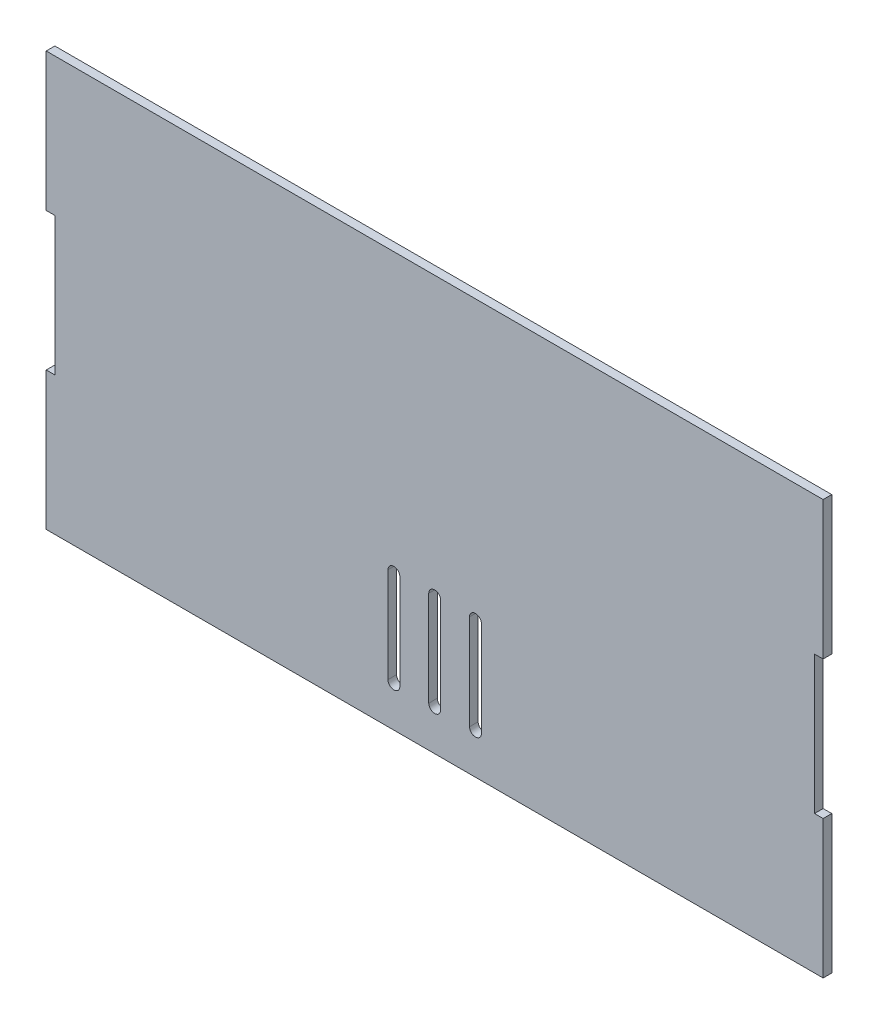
from build123d import *

# Parameters (mm, degrees)
SKETCH1_W           = 285.75
SKETCH1_H           = 3.175
BOSS_EXTRUDE1_DEPTH = 152.4
SKETCH2_W           = 3.175
SKETCH2_H           = 50.8
CUT_EXTRUDE1_DEPTH  = 209.92368523
CUT_EXTRUDE2_DEPTH  = 209.92368523


with BuildPart() as part:
    # Sketch1 → Boss-Extrude1 (new body)
    with BuildSketch(Plane(origin=(0, 0, 0), x_dir=(1, 0, 0), z_dir=(0, 1, 0))):
        Rectangle(SKETCH1_W, SKETCH1_H)
    extrude(amount=BOSS_EXTRUDE1_DEPTH)

    # Sketch2 → Cut-Extrude1 (cut, through all)
    with BuildSketch(Plane.XY.offset(1.5875)):
        with Locations((-141.2875, 76.2)):
            Rectangle(SKETCH2_W, SKETCH2_H)
    cut_extrude1 = extrude(amount=-CUT_EXTRUDE1_DEPTH, mode=Mode.SUBTRACT)

    # Mirror1: Cut-Extrude1 across plane
    add(cut_extrude1.mirror(Plane(origin=(0, 0, 0), x_dir=(0, 0, 1), z_dir=(1, 0, 0))), mode=Mode.SUBTRACT)

    # Sketch3 → Cut-Extrude2 (cut, through all)
    with BuildSketch(Plane.XY.offset(1.5875)):
        with BuildLine():
            Line((-12.8156, 15), (-12.8156, 50))
            ThreePointArc((-12.8156, 50), (-15, 52.1844), (-17.1844, 50))
            Line((-17.1844, 50), (-17.1844, 15))
            ThreePointArc((-17.1844, 15), (-15, 12.8156), (-12.8156, 15))
        make_face()
        with BuildLine():
            Line((2.1844, 15), (2.1844, 50))
            ThreePointArc((2.1844, 50), (0, 52.1844), (-2.1844, 50))
            Line((-2.1844, 50), (-2.1844, 15))
            ThreePointArc((-2.1844, 15), (0, 12.8156), (2.1844, 15))
        make_face()
        with BuildLine():
            Line((17.1844, 15), (17.1844, 50))
            ThreePointArc((17.1844, 50), (15, 52.1844), (12.8156, 50))
            Line((12.8156, 50), (12.8156, 15))
            ThreePointArc((12.8156, 15), (15, 12.8156), (17.1844, 15))
        make_face()
    extrude(amount=-CUT_EXTRUDE2_DEPTH, mode=Mode.SUBTRACT)


solid = part.part
